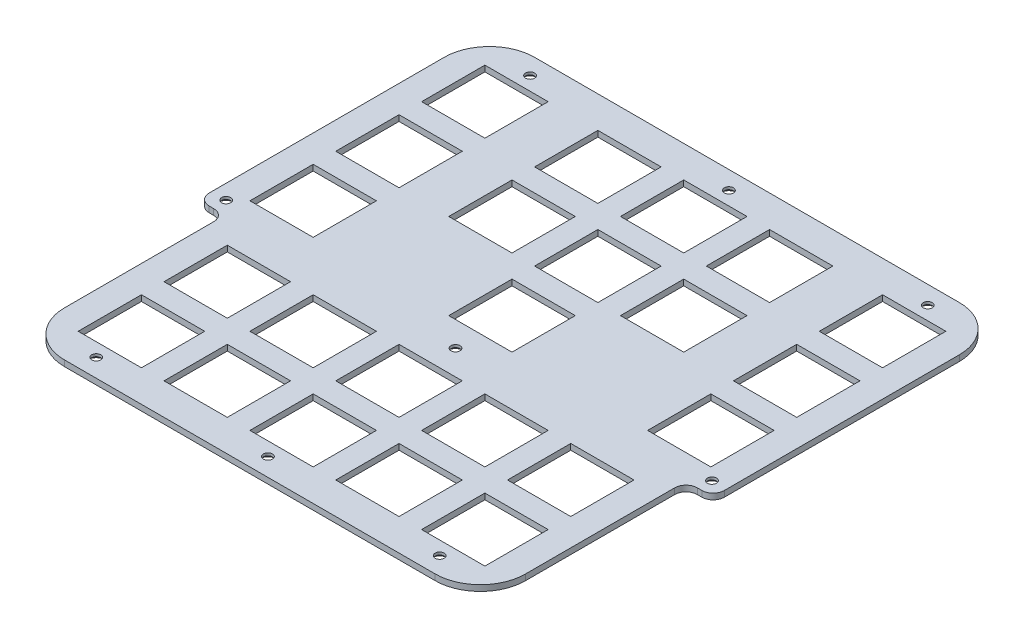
from build123d import *

# Parameters (mm, degrees)
SKETCH2_W                                    = 14
SKETCH2_H                                    = 14
BOSS_EXTRUDE1_DEPTH                          = 1.3
CSK_FOR_M2_CROSS_COUNTERSUNK_HEAD_SC_2_COUNT = 2
CSK_FOR_M2_CROSS_COUNTERSUNK_HEAD_SC_2_PITCH = 47.205005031
CSK_FOR_M2_CROSS_COUNTERSUNK_HEAD_SC_3_COUNT = 2
CSK_FOR_M2_CROSS_COUNTERSUNK_HEAD_SC_3_PITCH = 69.780459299
CSK_FOR_M2_CROSS_COUNTERSUNK_HEAD_SC_4_COUNT = 2
CSK_FOR_M2_CROSS_COUNTERSUNK_HEAD_SC_4_PITCH = 101.972116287
CSK_FOR_M2_CROSS_COUNTERSUNK_HEAD_SC_5_COUNT = 2
CSK_FOR_M2_CROSS_COUNTERSUNK_HEAD_SC_5_PITCH = 107.5
CSK_FOR_M2_CROSS_COUNTERSUNK_HEAD_SC_6_COUNT = 2
CSK_FOR_M2_CROSS_COUNTERSUNK_HEAD_SC_6_PITCH = 113.407726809
CSK_FOR_M2_CROSS_COUNTERSUNK_HEAD_SC_7_COUNT = 2
CSK_FOR_M2_CROSS_COUNTERSUNK_HEAD_SC_7_PITCH = 78.710307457
CSK_FOR_M2_CROSS_COUNTERSUNK_HEAD_SC_8_COUNT = 2
CSK_FOR_M2_CROSS_COUNTERSUNK_HEAD_SC_8_PITCH = 58.320772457
CSK_FOR_M2_CROSS_COUNTERSUNK_HEAD_SC_9_COUNT = 2
CSK_FOR_M2_CROSS_COUNTERSUNK_HEAD_SC_9_PITCH = 53.83365583


with BuildPart() as part:
    # Sketch2 → Boss-Extrude1 (new body)
    with BuildSketch(Plane(origin=(0, 0, 0), x_dir=(1, 0, 0), z_dir=(0, 1, 0))):
        with BuildLine():
            Line((-4, 5), (-4, 38))
            ThreePointArc((-4, 38), (-4.732233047, 39.767766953), (-6.5, 40.5))
            Line((-6.5, 40.5), (-7.5, 40.5))
            ThreePointArc((-7.5, 40.5), (-9.267766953, 41.232233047), (-10, 43))
            Line((-10, 43), (-10, 95))
            ThreePointArc((-10, 95), (-7.071067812, 102.071067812), (0, 105))
            Line((0, 105), (94, 105))
            ThreePointArc((94, 105), (101.071067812, 102.071067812), (104, 95))
            Line((104, 95), (104, 43))
            ThreePointArc((104, 43), (103.267766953, 41.232233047), (101.5, 40.5))
            Line((101.5, 40.5), (100.5, 40.5))
            ThreePointArc((100.5, 40.5), (98.732233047, 39.767766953), (98, 38))
            Line((98, 38), (98, 5))
            ThreePointArc((98, 5), (95.071067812, -2.071067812), (88, -5))
            Line((88, -5), (6, -5))
            ThreePointArc((6, -5), (-1.071067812, -2.071067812), (-4, 5))
        make_face()
        with Locations((9, 9)):
            Rectangle(SKETCH2_W, SKETCH2_H, mode=Mode.SUBTRACT)
        with Locations((28, 9)):
            Rectangle(SKETCH2_W, SKETCH2_H, mode=Mode.SUBTRACT)
        with Locations((47, 9)):
            Rectangle(SKETCH2_W, SKETCH2_H, mode=Mode.SUBTRACT)
        with Locations((66, 9)):
            Rectangle(SKETCH2_W, SKETCH2_H, mode=Mode.SUBTRACT)
        with Locations((85, 9)):
            Rectangle(SKETCH2_W, SKETCH2_H, mode=Mode.SUBTRACT)
        with Locations((28, 28)):
            Rectangle(SKETCH2_W, SKETCH2_H, mode=Mode.SUBTRACT)
        with Locations((47, 28)):
            Rectangle(SKETCH2_W, SKETCH2_H, mode=Mode.SUBTRACT)
        with Locations((66, 28)):
            Rectangle(SKETCH2_W, SKETCH2_H, mode=Mode.SUBTRACT)
        with Locations((85, 28)):
            Rectangle(SKETCH2_W, SKETCH2_H, mode=Mode.SUBTRACT)
        with Locations((9, 28)):
            Rectangle(SKETCH2_W, SKETCH2_H, mode=Mode.SUBTRACT)
        with Locations((47, 91)):
            Rectangle(SKETCH2_W, SKETCH2_H, mode=Mode.SUBTRACT)
        with Locations((28, 91)):
            Rectangle(SKETCH2_W, SKETCH2_H, mode=Mode.SUBTRACT)
        with Locations((66, 91)):
            Rectangle(SKETCH2_W, SKETCH2_H, mode=Mode.SUBTRACT)
        with Locations((47, 72)):
            Rectangle(SKETCH2_W, SKETCH2_H, mode=Mode.SUBTRACT)
        with Locations((66, 72)):
            Rectangle(SKETCH2_W, SKETCH2_H, mode=Mode.SUBTRACT)
        with Locations((47, 53)):
            Rectangle(SKETCH2_W, SKETCH2_H, mode=Mode.SUBTRACT)
        with Locations((28, 72)):
            Rectangle(SKETCH2_W, SKETCH2_H, mode=Mode.SUBTRACT)
        with Locations((3, 53)):
            Rectangle(SKETCH2_W, SKETCH2_H, mode=Mode.SUBTRACT)
        with Locations((3, 72)):
            Rectangle(SKETCH2_W, SKETCH2_H, mode=Mode.SUBTRACT)
        with Locations((3, 91)):
            Rectangle(SKETCH2_W, SKETCH2_H, mode=Mode.SUBTRACT)
        with Locations((91, 91)):
            Rectangle(SKETCH2_W, SKETCH2_H, mode=Mode.SUBTRACT)
        with Locations((91, 72)):
            Rectangle(SKETCH2_W, SKETCH2_H, mode=Mode.SUBTRACT)
        with Locations((91, 53)):
            Rectangle(SKETCH2_W, SKETCH2_H, mode=Mode.SUBTRACT)
    extrude(amount=BOSS_EXTRUDE1_DEPTH)

    # Sketch10 → CSK for M2 Cross Countersunk Head Screw4 (revolve, cut)
    with BuildSketch(Plane(origin=(-6.75, 0, -43.5), x_dir=(0, 0, -1), z_dir=(1, 0, 0))):
        Polygon((0, 0), (0, 1.3), (1, 1.3), (1, 0.724266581), (1.75, 0), align=None)
    csk_for_m2_cross_countersunk_head_screw4 = revolve(axis=Axis((-6.75, -6.35, -43.5), (0, 1, 0)), mode=Mode.SUBTRACT)

    # CSK for M2 Cross Countersunk Head Sc 2: CSK for M2 Cross Countersunk Head Screw4 ×2
    with Locations(*[Vector(0.3336510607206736, 0, 0.9426966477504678) * (i * CSK_FOR_M2_CROSS_COUNTERSUNK_HEAD_SC_2_PITCH) for i in range(1, CSK_FOR_M2_CROSS_COUNTERSUNK_HEAD_SC_2_COUNT)]):
        add(csk_for_m2_cross_countersunk_head_screw4, mode=Mode.SUBTRACT)

    # CSK for M2 Cross Countersunk Head Sc 3: CSK for M2 Cross Countersunk Head Screw4 ×2
    with Locations(*[Vector(0.770272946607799, 0, 0.6377143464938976) * (i * CSK_FOR_M2_CROSS_COUNTERSUNK_HEAD_SC_3_PITCH) for i in range(1, CSK_FOR_M2_CROSS_COUNTERSUNK_HEAD_SC_3_COUNT)]):
        add(csk_for_m2_cross_countersunk_head_screw4, mode=Mode.SUBTRACT)

    # CSK for M2 Cross Countersunk Head Sc 4: CSK for M2 Cross Countersunk Head Screw4 ×2
    with Locations(*[Vector(0.8997557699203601, 0, 0.4363938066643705) * (i * CSK_FOR_M2_CROSS_COUNTERSUNK_HEAD_SC_4_PITCH) for i in range(1, CSK_FOR_M2_CROSS_COUNTERSUNK_HEAD_SC_4_COUNT)]):
        add(csk_for_m2_cross_countersunk_head_screw4, mode=Mode.SUBTRACT)

    # CSK for M2 Cross Countersunk Head Sc 5: CSK for M2 Cross Countersunk Head Screw4 ×2
    with Locations(*[(i * CSK_FOR_M2_CROSS_COUNTERSUNK_HEAD_SC_5_PITCH, 0, 0) for i in range(1, CSK_FOR_M2_CROSS_COUNTERSUNK_HEAD_SC_5_COUNT)]):
        add(csk_for_m2_cross_countersunk_head_screw4, mode=Mode.SUBTRACT)

    # CSK for M2 Cross Countersunk Head Sc 6: CSK for M2 Cross Countersunk Head Screw4 ×2
    with Locations(*[Vector(0.8619342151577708, 0, -0.5070201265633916) * (i * CSK_FOR_M2_CROSS_COUNTERSUNK_HEAD_SC_6_PITCH) for i in range(1, CSK_FOR_M2_CROSS_COUNTERSUNK_HEAD_SC_6_COUNT)]):
        add(csk_for_m2_cross_countersunk_head_screw4, mode=Mode.SUBTRACT)

    # CSK for M2 Cross Countersunk Head Sc 7: CSK for M2 Cross Countersunk Head Screw4 ×2
    with Locations(*[Vector(0.6828838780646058, 0, -0.7305269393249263) * (i * CSK_FOR_M2_CROSS_COUNTERSUNK_HEAD_SC_7_PITCH) for i in range(1, CSK_FOR_M2_CROSS_COUNTERSUNK_HEAD_SC_7_COUNT)]):
        add(csk_for_m2_cross_countersunk_head_screw4, mode=Mode.SUBTRACT)

    # CSK for M2 Cross Countersunk Head Sc 8: CSK for M2 Cross Countersunk Head Screw4 ×2
    with Locations(*[Vector(0.16717885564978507, 0, -0.9859265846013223) * (i * CSK_FOR_M2_CROSS_COUNTERSUNK_HEAD_SC_8_PITCH) for i in range(1, CSK_FOR_M2_CROSS_COUNTERSUNK_HEAD_SC_8_COUNT)]):
        add(csk_for_m2_cross_countersunk_head_screw4, mode=Mode.SUBTRACT)

    # CSK for M2 Cross Countersunk Head Sc 9: CSK for M2 Cross Countersunk Head Screw4 ×2
    with Locations(*[Vector(0.998446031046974, 0, 0.055727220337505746) * (i * CSK_FOR_M2_CROSS_COUNTERSUNK_HEAD_SC_9_PITCH) for i in range(1, CSK_FOR_M2_CROSS_COUNTERSUNK_HEAD_SC_9_COUNT)]):
        add(csk_for_m2_cross_countersunk_head_screw4, mode=Mode.SUBTRACT)


solid = part.part
